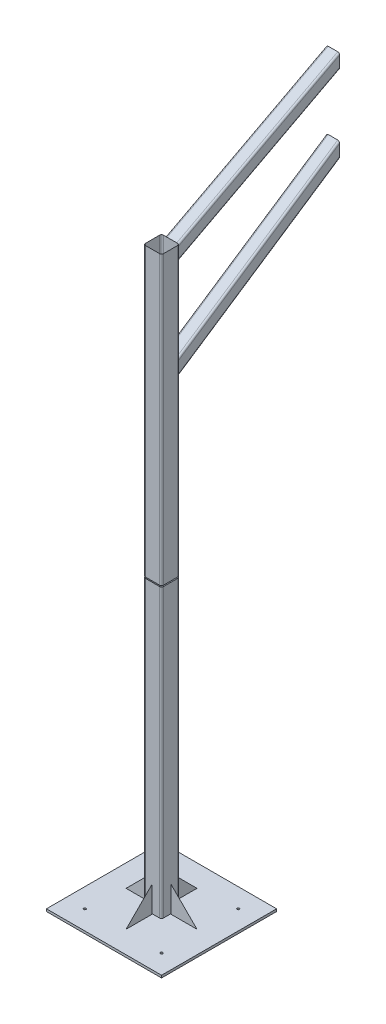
ISO-10303-21;
HEADER;
FILE_DESCRIPTION(('STEP AP214'),'2;1');
FILE_NAME('part.step','',(''),(''),'','','');
FILE_SCHEMA(('AUTOMOTIVE_DESIGN { 1 0 10303 214 1 1 1 1 }'));
ENDSEC;
DATA;
#1=APPLICATION_CONTEXT('core data for automotive mechanical design processes');
#2=APPLICATION_PROTOCOL_DEFINITION('international standard','automotive_design',2000,#1);
#3=PRODUCT_CONTEXT('',#1,'mechanical');
#4=PRODUCT('Part','Part','',(#3));
#5=PRODUCT_RELATED_PRODUCT_CATEGORY('part','',(#4));
#6=PRODUCT_DEFINITION_FORMATION('','',#4);
#7=PRODUCT_DEFINITION_CONTEXT('part definition',#1,'design');
#8=PRODUCT_DEFINITION('design','',#6,#7);
#9=PRODUCT_DEFINITION_SHAPE('','',#8);
#10=(LENGTH_UNIT() NAMED_UNIT(*) SI_UNIT(.MILLI.,.METRE.));
#11=(NAMED_UNIT(*) PLANE_ANGLE_UNIT() SI_UNIT($,.RADIAN.));
#12=(NAMED_UNIT(*) SI_UNIT($,.STERADIAN.) SOLID_ANGLE_UNIT());
#13=UNCERTAINTY_MEASURE_WITH_UNIT(LENGTH_MEASURE(1.E-05),#10,'distance_accuracy_value','');
#14=(GEOMETRIC_REPRESENTATION_CONTEXT(3) GLOBAL_UNCERTAINTY_ASSIGNED_CONTEXT((#13)) GLOBAL_UNIT_ASSIGNED_CONTEXT((#10,
#11,#12)) REPRESENTATION_CONTEXT('',''));
#15=CARTESIAN_POINT('',(0.,0.,0.));
#16=DIRECTION('',(0.,0.,1.));
#17=DIRECTION('',(1.,0.,0.));
#18=AXIS2_PLACEMENT_3D('',#15,#16,#17);
#19=CARTESIAN_POINT('',(47.625,3048.,38.1));
#20=DIRECTION('',(-1.,0.,0.));
#21=DIRECTION('',(0.,0.,1.));
#22=AXIS2_PLACEMENT_3D('',#19,#20,#21);
#23=PLANE('',#22);
#24=DIRECTION('',(0.,0.,-1.));
#25=VECTOR('',#24,1.);
#26=CARTESIAN_POINT('',(47.625,3048.,38.1));
#27=LINE('',#26,#25);
#28=CARTESIAN_POINT('',(47.625,3048.,38.1));
#29=VERTEX_POINT('',#28);
#30=CARTESIAN_POINT('',(47.625,3048.,-38.1));
#31=VERTEX_POINT('',#30);
#32=EDGE_CURVE('E130',#29,#31,#27,.T.);
#33=ORIENTED_EDGE('',*,*,#32,.T.);
#34=DIRECTION('',(0.,1.,0.));
#35=VECTOR('',#34,1.);
#36=CARTESIAN_POINT('',(47.625,3048.,-38.1));
#37=LINE('',#36,#35);
#38=CARTESIAN_POINT('',(47.625,1527.175,-38.1));
#39=VERTEX_POINT('',#38);
#40=EDGE_CURVE('E14',#31,#39,#37,.F.);
#41=ORIENTED_EDGE('',*,*,#40,.T.);
#42=DIRECTION('',(0.,0.,-1.));
#43=VECTOR('',#42,1.);
#44=CARTESIAN_POINT('',(47.625,1527.175,38.1));
#45=LINE('',#44,#43);
#46=CARTESIAN_POINT('',(47.625,1527.175,38.1));
#47=VERTEX_POINT('',#46);
#48=EDGE_CURVE('E218',#39,#47,#45,.F.);
#49=ORIENTED_EDGE('',*,*,#48,.T.);
#50=DIRECTION('',(0.,-1.,0.));
#51=VECTOR('',#50,1.);
#52=CARTESIAN_POINT('',(47.625,3048.,38.1));
#53=LINE('',#52,#51);
#54=EDGE_CURVE('E216',#29,#47,#53,.T.);
#55=ORIENTED_EDGE('',*,*,#54,.F.);
#56=EDGE_LOOP('',(#33,#41,#49,#55));
#57=FACE_BOUND('',#56,.T.);
#58=ADVANCED_FACE('F122',(#57),#23,.T.);
#59=CARTESIAN_POINT('',(38.1,3048.,-38.1));
#60=DIRECTION('',(0.,-1.,0.));
#61=DIRECTION('',(0.,0.,-1.));
#62=AXIS2_PLACEMENT_3D('',#59,#60,#61);
#63=CYLINDRICAL_SURFACE('',#62,9.525);
#64=CARTESIAN_POINT('',(38.1,3048.,-38.1));
#65=DIRECTION('',(0.,1.,0.));
#66=DIRECTION('',(0.,0.,1.));
#67=AXIS2_PLACEMENT_3D('',#64,#65,#66);
#68=CIRCLE('',#67,9.525);
#69=CARTESIAN_POINT('',(38.1,3048.,-47.625));
#70=VERTEX_POINT('',#69);
#71=EDGE_CURVE('E222',#31,#70,#68,.T.);
#72=ORIENTED_EDGE('',*,*,#71,.T.);
#73=DIRECTION('',(0.,-1.,0.));
#74=VECTOR('',#73,1.);
#75=CARTESIAN_POINT('',(38.1,3048.,-47.625));
#76=LINE('',#75,#74);
#77=CARTESIAN_POINT('',(38.1,1527.175,-47.625));
#78=VERTEX_POINT('',#77);
#79=EDGE_CURVE('E219',#70,#78,#76,.T.);
#80=ORIENTED_EDGE('',*,*,#79,.T.);
#81=CARTESIAN_POINT('',(38.1,1527.175,-38.1));
#82=DIRECTION('',(0.,1.,0.));
#83=DIRECTION('',(0.,0.,1.));
#84=AXIS2_PLACEMENT_3D('',#81,#82,#83);
#85=CIRCLE('',#84,9.525);
#86=EDGE_CURVE('E223',#78,#39,#85,.F.);
#87=ORIENTED_EDGE('',*,*,#86,.T.);
#88=ORIENTED_EDGE('',*,*,#40,.F.);
#89=EDGE_LOOP('',(#72,#80,#87,#88));
#90=FACE_BOUND('',#89,.T.);
#91=ADVANCED_FACE('F332',(#90),#63,.F.);
#92=CARTESIAN_POINT('',(38.1,3048.,38.1));
#93=DIRECTION('',(0.,-1.,0.));
#94=DIRECTION('',(0.,0.,-1.));
#95=AXIS2_PLACEMENT_3D('',#92,#93,#94);
#96=CYLINDRICAL_SURFACE('',#95,9.525);
#97=CARTESIAN_POINT('',(38.1,3048.,38.1));
#98=DIRECTION('',(0.,1.,0.));
#99=DIRECTION('',(0.,0.,1.));
#100=AXIS2_PLACEMENT_3D('',#97,#98,#99);
#101=CIRCLE('',#100,9.525);
#102=CARTESIAN_POINT('',(38.1,3048.,47.625));
#103=VERTEX_POINT('',#102);
#104=EDGE_CURVE('E264',#103,#29,#101,.T.);
#105=ORIENTED_EDGE('',*,*,#104,.T.);
#106=ORIENTED_EDGE('',*,*,#54,.T.);
#107=CARTESIAN_POINT('',(38.1,1527.175,38.1));
#108=DIRECTION('',(0.,1.,0.));
#109=DIRECTION('',(0.,0.,1.));
#110=AXIS2_PLACEMENT_3D('',#107,#108,#109);
#111=CIRCLE('',#110,9.525);
#112=CARTESIAN_POINT('',(38.1,1527.175,47.625));
#113=VERTEX_POINT('',#112);
#114=EDGE_CURVE('E226',#47,#113,#111,.F.);
#115=ORIENTED_EDGE('',*,*,#114,.T.);
#116=DIRECTION('',(0.,1.,0.));
#117=VECTOR('',#116,1.);
#118=CARTESIAN_POINT('',(38.1,3048.,47.625));
#119=LINE('',#118,#117);
#120=EDGE_CURVE('E224',#103,#113,#119,.F.);
#121=ORIENTED_EDGE('',*,*,#120,.F.);
#122=EDGE_LOOP('',(#105,#106,#115,#121));
#123=FACE_BOUND('',#122,.T.);
#124=ADVANCED_FACE('F284',(#123),#96,.F.);
#125=CARTESIAN_POINT('',(-38.1,3048.,-47.625));
#126=DIRECTION('',(0.,0.,1.));
#127=DIRECTION('',(1.,0.,0.));
#128=AXIS2_PLACEMENT_3D('',#125,#126,#127);
#129=PLANE('',#128);
#130=DIRECTION('',(-1.,0.,0.));
#131=VECTOR('',#130,1.);
#132=CARTESIAN_POINT('',(-38.1,3048.,-47.625));
#133=LINE('',#132,#131);
#134=CARTESIAN_POINT('',(-38.1,3048.,-47.625));
#135=VERTEX_POINT('',#134);
#136=EDGE_CURVE('E227',#70,#135,#133,.T.);
#137=ORIENTED_EDGE('',*,*,#136,.T.);
#138=DIRECTION('',(0.,-1.,0.));
#139=VECTOR('',#138,1.);
#140=CARTESIAN_POINT('',(-38.1,2289.175,-47.625));
#141=LINE('',#140,#139);
#142=CARTESIAN_POINT('',(-38.1,1527.175,-47.625));
#143=VERTEX_POINT('',#142);
#144=EDGE_CURVE('E236',#135,#143,#141,.T.);
#145=ORIENTED_EDGE('',*,*,#144,.T.);
#146=DIRECTION('',(-1.,0.,0.));
#147=VECTOR('',#146,1.);
#148=CARTESIAN_POINT('',(-38.1,1527.175,-47.625));
#149=LINE('',#148,#147);
#150=EDGE_CURVE('E247',#143,#78,#149,.F.);
#151=ORIENTED_EDGE('',*,*,#150,.T.);
#152=ORIENTED_EDGE('',*,*,#79,.F.);
#153=EDGE_LOOP('',(#137,#145,#151,#152));
#154=FACE_BOUND('',#153,.T.);
#155=ADVANCED_FACE('F240',(#154),#129,.T.);
#156=CARTESIAN_POINT('',(38.1,3048.,47.625));
#157=DIRECTION('',(0.,0.,-1.));
#158=DIRECTION('',(-1.,0.,0.));
#159=AXIS2_PLACEMENT_3D('',#156,#157,#158);
#160=PLANE('',#159);
#161=DIRECTION('',(0.,-1.,0.));
#162=VECTOR('',#161,1.);
#163=CARTESIAN_POINT('',(-38.1,3048.,47.625));
#164=LINE('',#163,#162);
#165=CARTESIAN_POINT('',(-38.1,3048.,47.625));
#166=VERTEX_POINT('',#165);
#167=CARTESIAN_POINT('',(-38.1,1527.175,47.625));
#168=VERTEX_POINT('',#167);
#169=EDGE_CURVE('E193',#166,#168,#164,.T.);
#170=ORIENTED_EDGE('',*,*,#169,.F.);
#171=DIRECTION('',(1.,0.,0.));
#172=VECTOR('',#171,1.);
#173=CARTESIAN_POINT('',(38.1,3048.,47.625));
#174=LINE('',#173,#172);
#175=EDGE_CURVE('E228',#166,#103,#174,.T.);
#176=ORIENTED_EDGE('',*,*,#175,.T.);
#177=ORIENTED_EDGE('',*,*,#120,.T.);
#178=DIRECTION('',(1.,0.,0.));
#179=VECTOR('',#178,1.);
#180=CARTESIAN_POINT('',(38.1,1527.175,47.625));
#181=LINE('',#180,#179);
#182=EDGE_CURVE('E211',#113,#168,#181,.F.);
#183=ORIENTED_EDGE('',*,*,#182,.T.);
#184=EDGE_LOOP('',(#170,#176,#177,#183));
#185=FACE_BOUND('',#184,.T.);
#186=ADVANCED_FACE('F287',(#185),#160,.T.);
#187=CARTESIAN_POINT('',(-38.1,3048.,-38.1));
#188=DIRECTION('',(0.,-1.,0.));
#189=DIRECTION('',(0.,0.,-1.));
#190=AXIS2_PLACEMENT_3D('',#187,#188,#189);
#191=CYLINDRICAL_SURFACE('',#190,9.52500000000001);
#192=CARTESIAN_POINT('',(-38.1,3048.,-38.1));
#193=DIRECTION('',(0.,1.,0.));
#194=DIRECTION('',(0.,0.,1.));
#195=AXIS2_PLACEMENT_3D('',#192,#193,#194);
#196=CIRCLE('',#195,9.52500000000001);
#197=CARTESIAN_POINT('',(-47.625,3048.,-38.1));
#198=VERTEX_POINT('',#197);
#199=EDGE_CURVE('E207',#135,#198,#196,.T.);
#200=ORIENTED_EDGE('',*,*,#199,.T.);
#201=DIRECTION('',(0.,-1.,0.));
#202=VECTOR('',#201,1.);
#203=CARTESIAN_POINT('',(-47.625,3048.,-38.1));
#204=LINE('',#203,#202);
#205=CARTESIAN_POINT('',(-47.625,1527.175,-38.1));
#206=VERTEX_POINT('',#205);
#207=EDGE_CURVE('E212',#198,#206,#204,.T.);
#208=ORIENTED_EDGE('',*,*,#207,.T.);
#209=CARTESIAN_POINT('',(-38.1,1527.175,-38.1));
#210=DIRECTION('',(0.,1.,0.));
#211=DIRECTION('',(0.,0.,1.));
#212=AXIS2_PLACEMENT_3D('',#209,#210,#211);
#213=CIRCLE('',#212,9.52500000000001);
#214=EDGE_CURVE('E202',#206,#143,#213,.F.);
#215=ORIENTED_EDGE('',*,*,#214,.T.);
#216=ORIENTED_EDGE('',*,*,#144,.F.);
#217=EDGE_LOOP('',(#200,#208,#215,#216));
#218=FACE_BOUND('',#217,.T.);
#219=ADVANCED_FACE('F231',(#218),#191,.F.);
#220=CARTESIAN_POINT('',(-38.1,3048.,38.1));
#221=DIRECTION('',(0.,-1.,0.));
#222=DIRECTION('',(0.,0.,-1.));
#223=AXIS2_PLACEMENT_3D('',#220,#221,#222);
#224=CYLINDRICAL_SURFACE('',#223,9.525);
#225=CARTESIAN_POINT('',(-38.1,3048.,38.1));
#226=DIRECTION('',(0.,1.,0.));
#227=DIRECTION('',(0.,0.,1.));
#228=AXIS2_PLACEMENT_3D('',#225,#226,#227);
#229=CIRCLE('',#228,9.525);
#230=CARTESIAN_POINT('',(-47.625,3048.,38.1));
#231=VERTEX_POINT('',#230);
#232=EDGE_CURVE('E196',#231,#166,#229,.T.);
#233=ORIENTED_EDGE('',*,*,#232,.T.);
#234=ORIENTED_EDGE('',*,*,#169,.T.);
#235=CARTESIAN_POINT('',(-38.1,1527.175,38.1));
#236=DIRECTION('',(0.,1.,0.));
#237=DIRECTION('',(0.,0.,1.));
#238=AXIS2_PLACEMENT_3D('',#235,#236,#237);
#239=CIRCLE('',#238,9.525);
#240=CARTESIAN_POINT('',(-47.625,1527.175,38.1));
#241=VERTEX_POINT('',#240);
#242=EDGE_CURVE('E187',#168,#241,#239,.F.);
#243=ORIENTED_EDGE('',*,*,#242,.T.);
#244=DIRECTION('',(0.,1.,0.));
#245=VECTOR('',#244,1.);
#246=CARTESIAN_POINT('',(-47.625,3048.,38.1));
#247=LINE('',#246,#245);
#248=EDGE_CURVE('E125',#231,#241,#247,.F.);
#249=ORIENTED_EDGE('',*,*,#248,.F.);
#250=EDGE_LOOP('',(#233,#234,#243,#249));
#251=FACE_BOUND('',#250,.T.);
#252=ADVANCED_FACE('F191',(#251),#224,.F.);
#253=CARTESIAN_POINT('',(-47.625,3048.,-38.1));
#254=DIRECTION('',(1.,0.,0.));
#255=DIRECTION('',(0.,0.,-1.));
#256=AXIS2_PLACEMENT_3D('',#253,#254,#255);
#257=PLANE('',#256);
#258=DIRECTION('',(0.,0.,1.));
#259=VECTOR('',#258,1.);
#260=CARTESIAN_POINT('',(-47.625,3048.,-38.1));
#261=LINE('',#260,#259);
#262=EDGE_CURVE('E179',#198,#231,#261,.T.);
#263=ORIENTED_EDGE('',*,*,#262,.T.);
#264=ORIENTED_EDGE('',*,*,#248,.T.);
#265=DIRECTION('',(0.,0.,1.));
#266=VECTOR('',#265,1.);
#267=CARTESIAN_POINT('',(-47.625,1527.175,-38.1));
#268=LINE('',#267,#266);
#269=EDGE_CURVE('E183',#241,#206,#268,.F.);
#270=ORIENTED_EDGE('',*,*,#269,.T.);
#271=ORIENTED_EDGE('',*,*,#207,.F.);
#272=EDGE_LOOP('',(#263,#264,#270,#271));
#273=FACE_BOUND('',#272,.T.);
#274=ADVANCED_FACE('F123',(#273),#257,.T.);
#275=OPEN_SHELL('',(#58,#91,#124,#155,#186,#219,#252,#274));
#276=SHELL_BASED_SURFACE_MODEL('B2',(#275));
#277=CARTESIAN_POINT('',(34.925,2949.33662727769,-11.8556689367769));
#278=DIRECTION('',(-1.,0.,0.));
#279=DIRECTION('',(0.,0.,1.));
#280=AXIS2_PLACEMENT_3D('',#277,#278,#279);
#281=PLANE('',#280);
#282=DIRECTION('',(0.,0.466758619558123,-0.88438475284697));
#283=VECTOR('',#282,1.);
#284=CARTESIAN_POINT('',(34.925,2969.89057978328,-50.8000000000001));
#285=LINE('',#284,#283);
#286=CARTESIAN_POINT('',(34.9249999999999,2969.89057978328,-50.8));
#287=VERTEX_POINT('',#286);
#288=CARTESIAN_POINT('',(34.9249999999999,3422.32807978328,-908.05));
#289=VERTEX_POINT('',#288);
#290=EDGE_CURVE('E424',#287,#289,#285,.T.);
#291=ORIENTED_EDGE('',*,*,#290,.T.);
#292=DIRECTION('',(0.,1.,0.));
#293=VECTOR('',#292,1.);
#294=CARTESIAN_POINT('',(34.925,2949.33662727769,-908.05));
#295=LINE('',#294,#293);
#296=CARTESIAN_POINT('',(34.9249999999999,3479.76914243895,-908.05));
#297=VERTEX_POINT('',#296);
#298=EDGE_CURVE('E120',#289,#297,#295,.T.);
#299=ORIENTED_EDGE('',*,*,#298,.T.);
#300=DIRECTION('',(0.,0.466758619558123,-0.88438475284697));
#301=VECTOR('',#300,1.);
#302=CARTESIAN_POINT('',(34.9249999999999,2994.26337272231,11.8556689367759));
#303=LINE('',#302,#301);
#304=CARTESIAN_POINT('',(34.9249999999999,3027.33164243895,-50.8));
#305=VERTEX_POINT('',#304);
#306=EDGE_CURVE('E550',#305,#297,#303,.T.);
#307=ORIENTED_EDGE('',*,*,#306,.F.);
#308=DIRECTION('',(0.,-1.,0.));
#309=VECTOR('',#308,1.);
#310=CARTESIAN_POINT('',(34.925,2949.33662727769,-50.8));
#311=LINE('',#310,#309);
#312=EDGE_CURVE('E547',#305,#287,#311,.T.);
#313=ORIENTED_EDGE('',*,*,#312,.T.);
#314=EDGE_LOOP('',(#291,#299,#307,#313));
#315=FACE_BOUND('',#314,.T.);
#316=ADVANCED_FACE('F415',(#315),#281,.F.);
#317=CARTESIAN_POINT('',(25.4,2949.33662727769,-11.8556689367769));
#318=DIRECTION('',(0.,0.466758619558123,-0.88438475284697));
#319=DIRECTION('',(0.,0.88438475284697,0.466758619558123));
#320=AXIS2_PLACEMENT_3D('',#317,#318,#319);
#321=CYLINDRICAL_SURFACE('',#320,9.52499999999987);
#322=DIRECTION('',(0.,0.466758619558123,-0.88438475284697));
#323=VECTOR('',#322,1.);
#324=CARTESIAN_POINT('',(25.4,2940.91286250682,-16.301544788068));
#325=LINE('',#324,#323);
#326=CARTESIAN_POINT('',(25.4,2959.12038053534,-50.8));
#327=VERTEX_POINT('',#326);
#328=CARTESIAN_POINT('',(25.4,3411.55788053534,-908.05));
#329=VERTEX_POINT('',#328);
#330=EDGE_CURVE('E542',#327,#329,#325,.T.);
#331=ORIENTED_EDGE('',*,*,#330,.T.);
#332=CARTESIAN_POINT('',(25.4,3422.32807978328,-908.05));
#333=DIRECTION('',(0.,0.,1.));
#334=DIRECTION('',(0.,1.,0.));
#335=AXIS2_PLACEMENT_3D('',#332,#333,#334);
#336=ELLIPSE('',#335,10.7701992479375,9.52499999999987);
#337=EDGE_CURVE('E433',#329,#289,#336,.T.);
#338=ORIENTED_EDGE('',*,*,#337,.T.);
#339=ORIENTED_EDGE('',*,*,#290,.F.);
#340=CARTESIAN_POINT('',(25.4,2969.89057978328,-50.8));
#341=DIRECTION('',(0.,0.,-1.));
#342=DIRECTION('',(0.,1.,0.));
#343=AXIS2_PLACEMENT_3D('',#340,#341,#342);
#344=ELLIPSE('',#343,10.7701992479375,9.52499999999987);
#345=EDGE_CURVE('E535',#287,#327,#344,.T.);
#346=ORIENTED_EDGE('',*,*,#345,.T.);
#347=EDGE_LOOP('',(#331,#338,#339,#346));
#348=FACE_BOUND('',#347,.T.);
#349=ADVANCED_FACE('F597',(#348),#321,.T.);
#350=CARTESIAN_POINT('',(25.4,2994.26337272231,11.8556689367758));
#351=DIRECTION('',(0.,0.466758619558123,-0.88438475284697));
#352=DIRECTION('',(0.,0.88438475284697,0.466758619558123));
#353=AXIS2_PLACEMENT_3D('',#350,#351,#352);
#354=CYLINDRICAL_SURFACE('',#353,9.52499999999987);
#355=ORIENTED_EDGE('',*,*,#306,.T.);
#356=CARTESIAN_POINT('',(25.4,3479.76914243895,-908.05));
#357=DIRECTION('',(0.,0.,1.));
#358=DIRECTION('',(0.,1.,0.));
#359=AXIS2_PLACEMENT_3D('',#356,#357,#358);
#360=ELLIPSE('',#359,10.7701992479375,9.52499999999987);
#361=CARTESIAN_POINT('',(25.4,3490.53934168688,-908.05));
#362=VERTEX_POINT('',#361);
#363=EDGE_CURVE('E530',#297,#362,#360,.T.);
#364=ORIENTED_EDGE('',*,*,#363,.T.);
#365=DIRECTION('',(0.,0.466758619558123,-0.88438475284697));
#366=VECTOR('',#365,1.);
#367=CARTESIAN_POINT('',(25.4,3002.68713749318,16.3015447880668));
#368=LINE('',#367,#366);
#369=CARTESIAN_POINT('',(25.4,3038.10184168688,-50.8));
#370=VERTEX_POINT('',#369);
#371=EDGE_CURVE('E538',#370,#362,#368,.T.);
#372=ORIENTED_EDGE('',*,*,#371,.F.);
#373=CARTESIAN_POINT('',(25.4,3027.33164243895,-50.8));
#374=DIRECTION('',(0.,0.,-1.));
#375=DIRECTION('',(0.,1.,0.));
#376=AXIS2_PLACEMENT_3D('',#373,#374,#375);
#377=ELLIPSE('',#376,10.7701992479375,9.52499999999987);
#378=EDGE_CURVE('E536',#370,#305,#377,.T.);
#379=ORIENTED_EDGE('',*,*,#378,.T.);
#380=EDGE_LOOP('',(#355,#364,#372,#379));
#381=FACE_BOUND('',#380,.T.);
#382=ADVANCED_FACE('F604',(#381),#354,.T.);
#383=CARTESIAN_POINT('',(25.4,2940.91286250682,-16.301544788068));
#384=DIRECTION('',(0.,0.88438475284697,0.466758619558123));
#385=DIRECTION('',(0.,-0.466758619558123,0.88438475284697));
#386=AXIS2_PLACEMENT_3D('',#383,#384,#385);
#387=PLANE('',#386);
#388=DIRECTION('',(0.,-0.466758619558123,0.88438475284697));
#389=VECTOR('',#388,1.);
#390=CARTESIAN_POINT('',(-25.4,2940.91286250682,-16.301544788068));
#391=LINE('',#390,#389);
#392=CARTESIAN_POINT('',(-25.4,2959.12038053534,-50.8));
#393=VERTEX_POINT('',#392);
#394=CARTESIAN_POINT('',(-25.4,3411.55788053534,-908.05));
#395=VERTEX_POINT('',#394);
#396=EDGE_CURVE('E517',#393,#395,#391,.F.);
#397=ORIENTED_EDGE('',*,*,#396,.T.);
#398=DIRECTION('',(1.,0.,0.));
#399=VECTOR('',#398,1.);
#400=CARTESIAN_POINT('',(25.4,3411.55788053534,-908.05));
#401=LINE('',#400,#399);
#402=EDGE_CURVE('E512',#395,#329,#401,.T.);
#403=ORIENTED_EDGE('',*,*,#402,.T.);
#404=ORIENTED_EDGE('',*,*,#330,.F.);
#405=DIRECTION('',(-1.,0.,0.));
#406=VECTOR('',#405,1.);
#407=CARTESIAN_POINT('',(25.4,2959.12038053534,-50.8));
#408=LINE('',#407,#406);
#409=EDGE_CURVE('E518',#327,#393,#408,.T.);
#410=ORIENTED_EDGE('',*,*,#409,.T.);
#411=EDGE_LOOP('',(#397,#403,#404,#410));
#412=FACE_BOUND('',#411,.T.);
#413=ADVANCED_FACE('F577',(#412),#387,.F.);
#414=CARTESIAN_POINT('',(-25.4,3002.68713749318,16.3015447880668));
#415=DIRECTION('',(0.,-0.88438475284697,-0.466758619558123));
#416=DIRECTION('',(0.,0.466758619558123,-0.88438475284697));
#417=AXIS2_PLACEMENT_3D('',#414,#415,#416);
#418=PLANE('',#417);
#419=ORIENTED_EDGE('',*,*,#371,.T.);
#420=DIRECTION('',(-1.,0.,0.));
#421=VECTOR('',#420,1.);
#422=CARTESIAN_POINT('',(-25.4,3490.53934168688,-908.05));
#423=LINE('',#422,#421);
#424=CARTESIAN_POINT('',(-25.4,3490.53934168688,-908.05));
#425=VERTEX_POINT('',#424);
#426=EDGE_CURVE('E523',#362,#425,#423,.T.);
#427=ORIENTED_EDGE('',*,*,#426,.T.);
#428=DIRECTION('',(0.,0.466758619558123,-0.88438475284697));
#429=VECTOR('',#428,1.);
#430=CARTESIAN_POINT('',(-25.4,3002.68713749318,16.3015447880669));
#431=LINE('',#430,#429);
#432=CARTESIAN_POINT('',(-25.4,3038.10184168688,-50.8));
#433=VERTEX_POINT('',#432);
#434=EDGE_CURVE('E491',#433,#425,#431,.T.);
#435=ORIENTED_EDGE('',*,*,#434,.F.);
#436=DIRECTION('',(1.,0.,0.));
#437=VECTOR('',#436,1.);
#438=CARTESIAN_POINT('',(-25.4,3038.10184168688,-50.8));
#439=LINE('',#438,#437);
#440=EDGE_CURVE('E520',#433,#370,#439,.T.);
#441=ORIENTED_EDGE('',*,*,#440,.T.);
#442=EDGE_LOOP('',(#419,#427,#435,#441));
#443=FACE_BOUND('',#442,.T.);
#444=ADVANCED_FACE('F611',(#443),#418,.F.);
#445=CARTESIAN_POINT('',(-25.4,2949.33662727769,-11.8556689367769));
#446=DIRECTION('',(0.,0.466758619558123,-0.88438475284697));
#447=DIRECTION('',(0.,0.88438475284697,0.466758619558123));
#448=AXIS2_PLACEMENT_3D('',#445,#446,#447);
#449=CYLINDRICAL_SURFACE('',#448,9.52499999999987);
#450=DIRECTION('',(0.,0.466758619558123,-0.88438475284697));
#451=VECTOR('',#450,1.);
#452=CARTESIAN_POINT('',(-34.9249999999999,2949.33662727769,-11.8556689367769));
#453=LINE('',#452,#451);
#454=CARTESIAN_POINT('',(-34.9249999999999,2969.89057978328,-50.8));
#455=VERTEX_POINT('',#454);
#456=CARTESIAN_POINT('',(-34.9249999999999,3422.32807978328,-908.05));
#457=VERTEX_POINT('',#456);
#458=EDGE_CURVE('E565',#455,#457,#453,.T.);
#459=ORIENTED_EDGE('',*,*,#458,.T.);
#460=CARTESIAN_POINT('',(-25.4,3422.32807978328,-908.05));
#461=DIRECTION('',(0.,0.,1.));
#462=DIRECTION('',(0.,1.,0.));
#463=AXIS2_PLACEMENT_3D('',#460,#461,#462);
#464=ELLIPSE('',#463,10.7701992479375,9.52499999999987);
#465=EDGE_CURVE('E501',#457,#395,#464,.T.);
#466=ORIENTED_EDGE('',*,*,#465,.T.);
#467=ORIENTED_EDGE('',*,*,#396,.F.);
#468=CARTESIAN_POINT('',(-25.4,2969.89057978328,-50.8));
#469=DIRECTION('',(0.,0.,-1.));
#470=DIRECTION('',(0.,1.,0.));
#471=AXIS2_PLACEMENT_3D('',#468,#469,#470);
#472=ELLIPSE('',#471,10.7701992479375,9.52499999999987);
#473=EDGE_CURVE('E494',#393,#455,#472,.T.);
#474=ORIENTED_EDGE('',*,*,#473,.T.);
#475=EDGE_LOOP('',(#459,#466,#467,#474));
#476=FACE_BOUND('',#475,.T.);
#477=ADVANCED_FACE('F573',(#476),#449,.T.);
#478=CARTESIAN_POINT('',(-25.4,2994.26337272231,11.8556689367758));
#479=DIRECTION('',(0.,0.466758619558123,-0.88438475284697));
#480=DIRECTION('',(0.,0.88438475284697,0.466758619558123));
#481=AXIS2_PLACEMENT_3D('',#478,#479,#480);
#482=CYLINDRICAL_SURFACE('',#481,9.52499999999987);
#483=ORIENTED_EDGE('',*,*,#434,.T.);
#484=CARTESIAN_POINT('',(-25.4,3479.76914243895,-908.05));
#485=DIRECTION('',(0.,0.,1.));
#486=DIRECTION('',(0.,1.,0.));
#487=AXIS2_PLACEMENT_3D('',#484,#485,#486);
#488=ELLIPSE('',#487,10.7701992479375,9.52499999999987);
#489=CARTESIAN_POINT('',(-34.9249999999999,3479.76914243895,-908.05));
#490=VERTEX_POINT('',#489);
#491=EDGE_CURVE('E488',#425,#490,#488,.T.);
#492=ORIENTED_EDGE('',*,*,#491,.T.);
#493=DIRECTION('',(0.,0.466758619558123,-0.88438475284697));
#494=VECTOR('',#493,1.);
#495=CARTESIAN_POINT('',(-34.925,3027.33164243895,-50.8000000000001));
#496=LINE('',#495,#494);
#497=CARTESIAN_POINT('',(-34.9249999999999,3027.33164243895,-50.8));
#498=VERTEX_POINT('',#497);
#499=EDGE_CURVE('E418',#498,#490,#496,.T.);
#500=ORIENTED_EDGE('',*,*,#499,.F.);
#501=CARTESIAN_POINT('',(-25.4,3027.33164243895,-50.8));
#502=DIRECTION('',(0.,0.,-1.));
#503=DIRECTION('',(0.,1.,0.));
#504=AXIS2_PLACEMENT_3D('',#501,#502,#503);
#505=ELLIPSE('',#504,10.7701992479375,9.52499999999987);
#506=EDGE_CURVE('E485',#498,#433,#505,.T.);
#507=ORIENTED_EDGE('',*,*,#506,.T.);
#508=EDGE_LOOP('',(#483,#492,#500,#507));
#509=FACE_BOUND('',#508,.T.);
#510=ADVANCED_FACE('F489',(#509),#482,.T.);
#511=CARTESIAN_POINT('',(-34.925,2994.26337272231,11.8556689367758));
#512=DIRECTION('',(1.,0.,0.));
#513=DIRECTION('',(0.,0.,-1.));
#514=AXIS2_PLACEMENT_3D('',#511,#512,#513);
#515=PLANE('',#514);
#516=ORIENTED_EDGE('',*,*,#458,.F.);
#517=DIRECTION('',(0.,1.,0.));
#518=VECTOR('',#517,1.);
#519=CARTESIAN_POINT('',(-34.925,2994.26337272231,-50.8));
#520=LINE('',#519,#518);
#521=EDGE_CURVE('E477',#455,#498,#520,.T.);
#522=ORIENTED_EDGE('',*,*,#521,.T.);
#523=ORIENTED_EDGE('',*,*,#499,.T.);
#524=DIRECTION('',(0.,-1.,0.));
#525=VECTOR('',#524,1.);
#526=CARTESIAN_POINT('',(-34.925,2994.26337272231,-908.05));
#527=LINE('',#526,#525);
#528=EDGE_CURVE('E480',#490,#457,#527,.T.);
#529=ORIENTED_EDGE('',*,*,#528,.T.);
#530=EDGE_LOOP('',(#516,#522,#523,#529));
#531=FACE_BOUND('',#530,.T.);
#532=ADVANCED_FACE('F416',(#531),#515,.F.);
#533=OPEN_SHELL('',(#316,#349,#382,#413,#444,#477,#510,#532));
#534=SHELL_BASED_SURFACE_MODEL('B8',(#533));
#535=CARTESIAN_POINT('',(34.925,3069.13407747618,-900.310615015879));
#536=DIRECTION('',(-1.,0.,0.));
#537=DIRECTION('',(0.,0.,1.));
#538=AXIS2_PLACEMENT_3D('',#535,#536,#537);
#539=PLANE('',#538);
#540=DIRECTION('',(0.,-0.554700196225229,0.832050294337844));
#541=VECTOR('',#540,1.);
#542=CARTESIAN_POINT('',(34.9249999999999,3026.86592252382,-928.48938498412));
#543=LINE('',#542,#541);
#544=CARTESIAN_POINT('',(34.9249999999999,3013.23966586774,-908.05));
#545=VERTEX_POINT('',#544);
#546=CARTESIAN_POINT('',(34.9249999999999,2441.73966586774,-50.8000000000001));
#547=VERTEX_POINT('',#546);
#548=EDGE_CURVE('E727',#545,#547,#543,.T.);
#549=ORIENTED_EDGE('',*,*,#548,.F.);
#550=DIRECTION('',(0.,1.,0.));
#551=VECTOR('',#550,1.);
#552=CARTESIAN_POINT('',(34.925,3069.13407747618,-908.05));
#553=LINE('',#552,#551);
#554=CARTESIAN_POINT('',(34.9249999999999,3074.2936674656,-908.05));
#555=VERTEX_POINT('',#554);
#556=EDGE_CURVE('E413',#545,#555,#553,.T.);
#557=ORIENTED_EDGE('',*,*,#556,.T.);
#558=DIRECTION('',(0.,-0.554700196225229,0.832050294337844));
#559=VECTOR('',#558,1.);
#560=CARTESIAN_POINT('',(34.925,3074.2936674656,-908.05));
#561=LINE('',#560,#559);
#562=CARTESIAN_POINT('',(34.925,2502.7936674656,-50.8000000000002));
#563=VERTEX_POINT('',#562);
#564=EDGE_CURVE('E978',#555,#563,#561,.T.);
#565=ORIENTED_EDGE('',*,*,#564,.T.);
#566=DIRECTION('',(0.,-1.,0.));
#567=VECTOR('',#566,1.);
#568=CARTESIAN_POINT('',(34.925,3069.13407747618,-50.8000000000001));
#569=LINE('',#568,#567);
#570=EDGE_CURVE('E855',#563,#547,#569,.T.);
#571=ORIENTED_EDGE('',*,*,#570,.T.);
#572=EDGE_LOOP('',(#549,#557,#565,#571));
#573=FACE_BOUND('',#572,.T.);
#574=ADVANCED_FACE('F718',(#573),#539,.F.);
#575=CARTESIAN_POINT('',(25.4,3026.86592252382,-928.489384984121));
#576=DIRECTION('',(0.,-0.554700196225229,0.832050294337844));
#577=DIRECTION('',(0.,-0.832050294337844,-0.554700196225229));
#578=AXIS2_PLACEMENT_3D('',#575,#576,#577);
#579=CYLINDRICAL_SURFACE('',#578,9.52499999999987);
#580=CARTESIAN_POINT('',(25.4,3013.23966586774,-908.05));
#581=DIRECTION('',(0.,0.,1.));
#582=DIRECTION('',(0.,-1.,0.));
#583=AXIS2_PLACEMENT_3D('',#580,#581,#582);
#584=ELLIPSE('',#583,11.447625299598,9.52499999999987);
#585=CARTESIAN_POINT('',(25.4,3001.79204056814,-908.05));
#586=VERTEX_POINT('',#585);
#587=EDGE_CURVE('E736',#586,#545,#584,.T.);
#588=ORIENTED_EDGE('',*,*,#587,.T.);
#589=ORIENTED_EDGE('',*,*,#548,.T.);
#590=CARTESIAN_POINT('',(25.4,2441.73966586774,-50.8000000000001));
#591=DIRECTION('',(0.,0.,-1.));
#592=DIRECTION('',(0.,-1.,0.));
#593=AXIS2_PLACEMENT_3D('',#590,#591,#592);
#594=ELLIPSE('',#593,11.447625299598,9.52499999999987);
#595=CARTESIAN_POINT('',(25.4,2430.29204056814,-50.8000000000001));
#596=VERTEX_POINT('',#595);
#597=EDGE_CURVE('E859',#547,#596,#594,.T.);
#598=ORIENTED_EDGE('',*,*,#597,.T.);
#599=DIRECTION('',(0.,-0.554700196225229,0.832050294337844));
#600=VECTOR('',#599,1.);
#601=CARTESIAN_POINT('',(25.4,3018.94064347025,-933.772904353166));
#602=LINE('',#601,#600);
#603=EDGE_CURVE('E841',#586,#596,#602,.T.);
#604=ORIENTED_EDGE('',*,*,#603,.F.);
#605=EDGE_LOOP('',(#588,#589,#598,#604));
#606=FACE_BOUND('',#605,.T.);
#607=ADVANCED_FACE('F937',(#606),#579,.T.);
#608=CARTESIAN_POINT('',(25.4,3069.13407747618,-900.310615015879));
#609=DIRECTION('',(0.,-0.554700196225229,0.832050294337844));
#610=DIRECTION('',(0.,-0.832050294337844,-0.554700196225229));
#611=AXIS2_PLACEMENT_3D('',#608,#609,#610);
#612=CYLINDRICAL_SURFACE('',#611,9.52499999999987);
#613=ORIENTED_EDGE('',*,*,#564,.F.);
#614=CARTESIAN_POINT('',(25.4,3074.2936674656,-908.05));
#615=DIRECTION('',(0.,0.,1.));
#616=DIRECTION('',(0.,-1.,0.));
#617=AXIS2_PLACEMENT_3D('',#614,#615,#616);
#618=ELLIPSE('',#617,11.447625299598,9.52499999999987);
#619=CARTESIAN_POINT('',(25.4,3085.74129276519,-908.05));
#620=VERTEX_POINT('',#619);
#621=EDGE_CURVE('E861',#555,#620,#618,.T.);
#622=ORIENTED_EDGE('',*,*,#621,.T.);
#623=DIRECTION('',(0.,-0.554700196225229,0.832050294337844));
#624=VECTOR('',#623,1.);
#625=CARTESIAN_POINT('',(25.4,3077.05935652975,-895.027095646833));
#626=LINE('',#625,#624);
#627=CARTESIAN_POINT('',(25.4,2514.24129276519,-50.8000000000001));
#628=VERTEX_POINT('',#627);
#629=EDGE_CURVE('E871',#620,#628,#626,.T.);
#630=ORIENTED_EDGE('',*,*,#629,.T.);
#631=CARTESIAN_POINT('',(25.4,2502.7936674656,-50.8000000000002));
#632=DIRECTION('',(0.,0.,-1.));
#633=DIRECTION('',(0.,-1.,0.));
#634=AXIS2_PLACEMENT_3D('',#631,#632,#633);
#635=ELLIPSE('',#634,11.447625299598,9.52499999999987);
#636=EDGE_CURVE('E850',#628,#563,#635,.T.);
#637=ORIENTED_EDGE('',*,*,#636,.T.);
#638=EDGE_LOOP('',(#613,#622,#630,#637));
#639=FACE_BOUND('',#638,.T.);
#640=ADVANCED_FACE('F896',(#639),#612,.T.);
#641=CARTESIAN_POINT('',(-25.4,3018.94064347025,-933.772904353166));
#642=DIRECTION('',(0.,0.832050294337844,0.554700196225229));
#643=DIRECTION('',(0.,-0.554700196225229,0.832050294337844));
#644=AXIS2_PLACEMENT_3D('',#641,#642,#643);
#645=PLANE('',#644);
#646=DIRECTION('',(1.,0.,0.));
#647=VECTOR('',#646,1.);
#648=CARTESIAN_POINT('',(-25.4,3001.79204056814,-908.05));
#649=LINE('',#648,#647);
#650=CARTESIAN_POINT('',(-25.4,3001.79204056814,-908.05));
#651=VERTEX_POINT('',#650);
#652=EDGE_CURVE('E844',#651,#586,#649,.T.);
#653=ORIENTED_EDGE('',*,*,#652,.T.);
#654=ORIENTED_EDGE('',*,*,#603,.T.);
#655=DIRECTION('',(-1.,0.,0.));
#656=VECTOR('',#655,1.);
#657=CARTESIAN_POINT('',(-25.4,2430.29204056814,-50.8000000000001));
#658=LINE('',#657,#656);
#659=CARTESIAN_POINT('',(-25.4,2430.29204056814,-50.8000000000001));
#660=VERTEX_POINT('',#659);
#661=EDGE_CURVE('E823',#596,#660,#658,.T.);
#662=ORIENTED_EDGE('',*,*,#661,.T.);
#663=DIRECTION('',(0.,-0.554700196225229,0.832050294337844));
#664=VECTOR('',#663,1.);
#665=CARTESIAN_POINT('',(-25.4,3018.94064347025,-933.772904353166));
#666=LINE('',#665,#664);
#667=EDGE_CURVE('E836',#651,#660,#666,.T.);
#668=ORIENTED_EDGE('',*,*,#667,.F.);
#669=EDGE_LOOP('',(#653,#654,#662,#668));
#670=FACE_BOUND('',#669,.T.);
#671=ADVANCED_FACE('F840',(#670),#645,.F.);
#672=CARTESIAN_POINT('',(25.4,3077.05935652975,-895.027095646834));
#673=DIRECTION('',(0.,-0.832050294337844,-0.554700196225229));
#674=DIRECTION('',(0.,0.554700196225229,-0.832050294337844));
#675=AXIS2_PLACEMENT_3D('',#672,#673,#674);
#676=PLANE('',#675);
#677=ORIENTED_EDGE('',*,*,#629,.F.);
#678=DIRECTION('',(-1.,0.,0.));
#679=VECTOR('',#678,1.);
#680=CARTESIAN_POINT('',(25.4,3085.74129276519,-908.05));
#681=LINE('',#680,#679);
#682=CARTESIAN_POINT('',(-25.4,3085.74129276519,-908.05));
#683=VERTEX_POINT('',#682);
#684=EDGE_CURVE('E818',#620,#683,#681,.T.);
#685=ORIENTED_EDGE('',*,*,#684,.T.);
#686=DIRECTION('',(0.,0.554700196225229,-0.832050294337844));
#687=VECTOR('',#686,1.);
#688=CARTESIAN_POINT('',(-25.4,3077.05935652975,-895.027095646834));
#689=LINE('',#688,#687);
#690=CARTESIAN_POINT('',(-25.4,2514.24129276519,-50.8000000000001));
#691=VERTEX_POINT('',#690);
#692=EDGE_CURVE('E881',#683,#691,#689,.F.);
#693=ORIENTED_EDGE('',*,*,#692,.T.);
#694=DIRECTION('',(1.,0.,0.));
#695=VECTOR('',#694,1.);
#696=CARTESIAN_POINT('',(25.4,2514.24129276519,-50.8000000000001));
#697=LINE('',#696,#695);
#698=EDGE_CURVE('E824',#691,#628,#697,.T.);
#699=ORIENTED_EDGE('',*,*,#698,.T.);
#700=EDGE_LOOP('',(#677,#685,#693,#699));
#701=FACE_BOUND('',#700,.T.);
#702=ADVANCED_FACE('F887',(#701),#676,.F.);
#703=CARTESIAN_POINT('',(-25.4,3026.86592252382,-928.489384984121));
#704=DIRECTION('',(0.,-0.554700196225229,0.832050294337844));
#705=DIRECTION('',(0.,-0.832050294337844,-0.554700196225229));
#706=AXIS2_PLACEMENT_3D('',#703,#704,#705);
#707=CYLINDRICAL_SURFACE('',#706,9.52499999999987);
#708=CARTESIAN_POINT('',(-25.4,3013.23966586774,-908.05));
#709=DIRECTION('',(0.,0.,1.));
#710=DIRECTION('',(0.,-1.,0.));
#711=AXIS2_PLACEMENT_3D('',#708,#709,#710);
#712=ELLIPSE('',#711,11.447625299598,9.52499999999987);
#713=CARTESIAN_POINT('',(-34.9249999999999,3013.23966586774,-908.05));
#714=VERTEX_POINT('',#713);
#715=EDGE_CURVE('E826',#714,#651,#712,.T.);
#716=ORIENTED_EDGE('',*,*,#715,.T.);
#717=ORIENTED_EDGE('',*,*,#667,.T.);
#718=CARTESIAN_POINT('',(-25.4,2441.73966586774,-50.8000000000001));
#719=DIRECTION('',(0.,0.,-1.));
#720=DIRECTION('',(0.,-1.,0.));
#721=AXIS2_PLACEMENT_3D('',#718,#719,#720);
#722=ELLIPSE('',#721,11.447625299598,9.52499999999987);
#723=CARTESIAN_POINT('',(-34.9249999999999,2441.73966586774,-50.8));
#724=VERTEX_POINT('',#723);
#725=EDGE_CURVE('E802',#660,#724,#722,.T.);
#726=ORIENTED_EDGE('',*,*,#725,.T.);
#727=DIRECTION('',(0.,-0.554700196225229,0.832050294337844));
#728=VECTOR('',#727,1.);
#729=CARTESIAN_POINT('',(-34.925,3013.23966586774,-908.05));
#730=LINE('',#729,#728);
#731=EDGE_CURVE('E784',#714,#724,#730,.T.);
#732=ORIENTED_EDGE('',*,*,#731,.F.);
#733=EDGE_LOOP('',(#716,#717,#726,#732));
#734=FACE_BOUND('',#733,.T.);
#735=ADVANCED_FACE('F834',(#734),#707,.T.);
#736=CARTESIAN_POINT('',(-25.4,3069.13407747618,-900.310615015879));
#737=DIRECTION('',(0.,-0.554700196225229,0.832050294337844));
#738=DIRECTION('',(0.,-0.832050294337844,-0.554700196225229));
#739=AXIS2_PLACEMENT_3D('',#736,#737,#738);
#740=CYLINDRICAL_SURFACE('',#739,9.52499999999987);
#741=ORIENTED_EDGE('',*,*,#692,.F.);
#742=CARTESIAN_POINT('',(-25.4,3074.2936674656,-908.05));
#743=DIRECTION('',(0.,0.,1.));
#744=DIRECTION('',(0.,-1.,0.));
#745=AXIS2_PLACEMENT_3D('',#742,#743,#744);
#746=ELLIPSE('',#745,11.447625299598,9.52499999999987);
#747=CARTESIAN_POINT('',(-34.9249999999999,3074.2936674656,-908.05));
#748=VERTEX_POINT('',#747);
#749=EDGE_CURVE('E796',#683,#748,#746,.T.);
#750=ORIENTED_EDGE('',*,*,#749,.T.);
#751=DIRECTION('',(0.,-0.554700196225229,0.832050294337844));
#752=VECTOR('',#751,1.);
#753=CARTESIAN_POINT('',(-34.9249999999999,3069.13407747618,-900.310615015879));
#754=LINE('',#753,#752);
#755=CARTESIAN_POINT('',(-34.9249999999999,2502.7936674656,-50.8000000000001));
#756=VERTEX_POINT('',#755);
#757=EDGE_CURVE('E721',#748,#756,#754,.T.);
#758=ORIENTED_EDGE('',*,*,#757,.T.);
#759=CARTESIAN_POINT('',(-25.4,2502.7936674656,-50.8000000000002));
#760=DIRECTION('',(0.,0.,-1.));
#761=DIRECTION('',(0.,-1.,0.));
#762=AXIS2_PLACEMENT_3D('',#759,#760,#761);
#763=ELLIPSE('',#762,11.447625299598,9.52499999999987);
#764=EDGE_CURVE('E793',#756,#691,#763,.T.);
#765=ORIENTED_EDGE('',*,*,#764,.T.);
#766=EDGE_LOOP('',(#741,#750,#758,#765));
#767=FACE_BOUND('',#766,.T.);
#768=ADVANCED_FACE('F792',(#767),#740,.T.);
#769=CARTESIAN_POINT('',(-34.925,3026.86592252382,-928.489384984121));
#770=DIRECTION('',(1.,0.,0.));
#771=DIRECTION('',(0.,0.,-1.));
#772=AXIS2_PLACEMENT_3D('',#769,#770,#771);
#773=PLANE('',#772);
#774=ORIENTED_EDGE('',*,*,#731,.T.);
#775=DIRECTION('',(0.,1.,0.));
#776=VECTOR('',#775,1.);
#777=CARTESIAN_POINT('',(-34.925,3026.86592252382,-50.8000000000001));
#778=LINE('',#777,#776);
#779=EDGE_CURVE('E782',#724,#756,#778,.T.);
#780=ORIENTED_EDGE('',*,*,#779,.T.);
#781=ORIENTED_EDGE('',*,*,#757,.F.);
#782=DIRECTION('',(0.,-1.,0.));
#783=VECTOR('',#782,1.);
#784=CARTESIAN_POINT('',(-34.925,3026.86592252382,-908.05));
#785=LINE('',#784,#783);
#786=EDGE_CURVE('E787',#748,#714,#785,.T.);
#787=ORIENTED_EDGE('',*,*,#786,.T.);
#788=EDGE_LOOP('',(#774,#780,#781,#787));
#789=FACE_BOUND('',#788,.T.);
#790=ADVANCED_FACE('F719',(#789),#773,.F.);
#791=OPEN_SHELL('',(#574,#607,#640,#671,#702,#735,#768,#790));
#792=SHELL_BASED_SURFACE_MODEL('B114',(#791));
#793=CARTESIAN_POINT('',(0.,0.,0.));
#794=DIRECTION('',(-1.,0.,0.));
#795=DIRECTION('',(0.,0.,1.));
#796=AXIS2_PLACEMENT_3D('',#793,#794,#795);
#797=PLANE('',#796);
#798=DIRECTION('',(0.,-0.707106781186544,0.707106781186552));
#799=VECTOR('',#798,1.);
#800=CARTESIAN_POINT('',(0.,93.9336649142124,93.9336649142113));
#801=LINE('',#800,#799);
#802=CARTESIAN_POINT('',(0.,137.067329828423,50.8));
#803=VERTEX_POINT('',#802);
#804=CARTESIAN_POINT('',(0.,0.,187.867329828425));
#805=VERTEX_POINT('',#804);
#806=EDGE_CURVE('E716',#803,#805,#801,.T.);
#807=ORIENTED_EDGE('',*,*,#806,.F.);
#808=DIRECTION('',(0.,1.,0.));
#809=VECTOR('',#808,1.);
#810=CARTESIAN_POINT('',(0.,0.,50.8));
#811=LINE('',#810,#809);
#812=CARTESIAN_POINT('',(0.,0.,50.8));
#813=VERTEX_POINT('',#812);
#814=EDGE_CURVE('E1035',#813,#803,#811,.T.);
#815=ORIENTED_EDGE('',*,*,#814,.F.);
#816=DIRECTION('',(0.,0.,-1.));
#817=VECTOR('',#816,1.);
#818=CARTESIAN_POINT('',(0.,0.,0.));
#819=LINE('',#818,#817);
#820=EDGE_CURVE('E1024',#805,#813,#819,.T.);
#821=ORIENTED_EDGE('',*,*,#820,.F.);
#822=EDGE_LOOP('',(#807,#815,#821));
#823=FACE_BOUND('',#822,.T.);
#824=ADVANCED_FACE('F1019',(#823),#797,.T.);
#825=OPEN_SHELL('',(#824));
#826=SHELL_BASED_SURFACE_MODEL('B407',(#825));
#827=CARTESIAN_POINT('',(0.,0.,0.));
#828=DIRECTION('',(0.,0.,-1.));
#829=DIRECTION('',(-1.,0.,0.));
#830=AXIS2_PLACEMENT_3D('',#827,#828,#829);
#831=PLANE('',#830);
#832=DIRECTION('',(-0.707106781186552,-0.707106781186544,0.));
#833=VECTOR('',#832,1.);
#834=CARTESIAN_POINT('',(-93.9336649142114,93.9336649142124,9.83902914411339E-13));
#835=LINE('',#834,#833);
#836=CARTESIAN_POINT('',(-50.8,137.067329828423,5.32101756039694E-13));
#837=VERTEX_POINT('',#836);
#838=CARTESIAN_POINT('',(-187.867329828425,0.,1.9678058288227E-12));
#839=VERTEX_POINT('',#838);
#840=EDGE_CURVE('E1081',#837,#839,#835,.T.);
#841=ORIENTED_EDGE('',*,*,#840,.T.);
#842=DIRECTION('',(1.,0.,0.));
#843=VECTOR('',#842,1.);
#844=CARTESIAN_POINT('',(0.,0.,0.));
#845=LINE('',#844,#843);
#846=CARTESIAN_POINT('',(-50.8,0.,5.32101756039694E-13));
#847=VERTEX_POINT('',#846);
#848=EDGE_CURVE('E1017',#839,#847,#845,.T.);
#849=ORIENTED_EDGE('',*,*,#848,.T.);
#850=DIRECTION('',(0.,1.,0.));
#851=VECTOR('',#850,1.);
#852=CARTESIAN_POINT('',(-50.8,0.,5.32101756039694E-13));
#853=LINE('',#852,#851);
#854=EDGE_CURVE('E1090',#847,#837,#853,.T.);
#855=ORIENTED_EDGE('',*,*,#854,.T.);
#856=EDGE_LOOP('',(#841,#849,#855));
#857=FACE_BOUND('',#856,.T.);
#858=ADVANCED_FACE('F1076',(#857),#831,.F.);
#859=OPEN_SHELL('',(#858));
#860=SHELL_BASED_SURFACE_MODEL('B710',(#859));
#861=CARTESIAN_POINT('',(0.,0.,0.));
#862=DIRECTION('',(0.,0.,1.));
#863=DIRECTION('',(1.,0.,0.));
#864=AXIS2_PLACEMENT_3D('',#861,#862,#863);
#865=PLANE('',#864);
#866=DIRECTION('',(0.707106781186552,-0.707106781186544,0.));
#867=VECTOR('',#866,1.);
#868=CARTESIAN_POINT('',(93.9336649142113,93.9336649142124,-3.27967638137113E-13));
#869=LINE('',#868,#867);
#870=CARTESIAN_POINT('',(50.8,137.067329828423,-1.77367252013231E-13));
#871=VERTEX_POINT('',#870);
#872=CARTESIAN_POINT('',(187.867329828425,0.,-6.56592835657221E-13));
#873=VERTEX_POINT('',#872);
#874=EDGE_CURVE('E1074',#871,#873,#869,.T.);
#875=ORIENTED_EDGE('',*,*,#874,.F.);
#876=DIRECTION('',(0.,1.,0.));
#877=VECTOR('',#876,1.);
#878=CARTESIAN_POINT('',(50.8,0.,-1.77367252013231E-13));
#879=LINE('',#878,#877);
#880=CARTESIAN_POINT('',(50.8,0.,-1.77367252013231E-13));
#881=VERTEX_POINT('',#880);
#882=EDGE_CURVE('E1149',#881,#871,#879,.T.);
#883=ORIENTED_EDGE('',*,*,#882,.F.);
#884=DIRECTION('',(-1.,0.,0.));
#885=VECTOR('',#884,1.);
#886=CARTESIAN_POINT('',(0.,0.,0.));
#887=LINE('',#886,#885);
#888=EDGE_CURVE('E1138',#873,#881,#887,.T.);
#889=ORIENTED_EDGE('',*,*,#888,.F.);
#890=EDGE_LOOP('',(#875,#883,#889));
#891=FACE_BOUND('',#890,.T.);
#892=ADVANCED_FACE('F1133',(#891),#865,.T.);
#893=OPEN_SHELL('',(#892));
#894=SHELL_BASED_SURFACE_MODEL('B1011',(#893));
#895=CARTESIAN_POINT('',(47.625,1524.,38.1));
#896=DIRECTION('',(-1.,0.,0.));
#897=DIRECTION('',(0.,0.,1.));
#898=AXIS2_PLACEMENT_3D('',#895,#896,#897);
#899=PLANE('',#898);
#900=DIRECTION('',(0.,0.,-1.));
#901=VECTOR('',#900,1.);
#902=CARTESIAN_POINT('',(47.625,1520.825,38.1));
#903=LINE('',#902,#901);
#904=CARTESIAN_POINT('',(47.625,1520.825,38.1));
#905=VERTEX_POINT('',#904);
#906=CARTESIAN_POINT('',(47.625,1520.825,-38.1));
#907=VERTEX_POINT('',#906);
#908=EDGE_CURVE('E1198',#905,#907,#903,.T.);
#909=ORIENTED_EDGE('',*,*,#908,.T.);
#910=DIRECTION('',(0.,1.,0.));
#911=VECTOR('',#910,1.);
#912=CARTESIAN_POINT('',(47.625,1524.,-38.1));
#913=LINE('',#912,#911);
#914=CARTESIAN_POINT('',(47.625,0.,-38.1));
#915=VERTEX_POINT('',#914);
#916=EDGE_CURVE('E1131',#907,#915,#913,.F.);
#917=ORIENTED_EDGE('',*,*,#916,.T.);
#918=DIRECTION('',(0.,0.,-1.));
#919=VECTOR('',#918,1.);
#920=CARTESIAN_POINT('',(47.625,0.,38.1));
#921=LINE('',#920,#919);
#922=CARTESIAN_POINT('',(47.625,0.,38.1));
#923=VERTEX_POINT('',#922);
#924=EDGE_CURVE('E1286',#923,#915,#921,.T.);
#925=ORIENTED_EDGE('',*,*,#924,.F.);
#926=DIRECTION('',(0.,-1.,0.));
#927=VECTOR('',#926,1.);
#928=CARTESIAN_POINT('',(47.625,1524.,38.1));
#929=LINE('',#928,#927);
#930=EDGE_CURVE('E1284',#905,#923,#929,.T.);
#931=ORIENTED_EDGE('',*,*,#930,.F.);
#932=EDGE_LOOP('',(#909,#917,#925,#931));
#933=FACE_BOUND('',#932,.T.);
#934=ADVANCED_FACE('F1190',(#933),#899,.T.);
#935=CARTESIAN_POINT('',(38.1,1524.,-38.1));
#936=DIRECTION('',(0.,-1.,0.));
#937=DIRECTION('',(0.,0.,-1.));
#938=AXIS2_PLACEMENT_3D('',#935,#936,#937);
#939=CYLINDRICAL_SURFACE('',#938,9.525);
#940=ORIENTED_EDGE('',*,*,#916,.F.);
#941=CARTESIAN_POINT('',(38.1,1520.825,-38.1));
#942=DIRECTION('',(0.,-1.,0.));
#943=DIRECTION('',(0.,0.,-1.));
#944=AXIS2_PLACEMENT_3D('',#941,#942,#943);
#945=CIRCLE('',#944,9.525);
#946=CARTESIAN_POINT('',(38.1,1520.825,-47.625));
#947=VERTEX_POINT('',#946);
#948=EDGE_CURVE('E1290',#907,#947,#945,.F.);
#949=ORIENTED_EDGE('',*,*,#948,.T.);
#950=DIRECTION('',(0.,-1.,0.));
#951=VECTOR('',#950,1.);
#952=CARTESIAN_POINT('',(38.1,1524.,-47.625));
#953=LINE('',#952,#951);
#954=CARTESIAN_POINT('',(38.1,0.,-47.625));
#955=VERTEX_POINT('',#954);
#956=EDGE_CURVE('E1287',#947,#955,#953,.T.);
#957=ORIENTED_EDGE('',*,*,#956,.T.);
#958=CARTESIAN_POINT('',(38.1,0.,-38.1));
#959=DIRECTION('',(0.,1.,0.));
#960=DIRECTION('',(0.,0.,1.));
#961=AXIS2_PLACEMENT_3D('',#958,#959,#960);
#962=CIRCLE('',#961,9.525);
#963=EDGE_CURVE('E1320',#915,#955,#962,.T.);
#964=ORIENTED_EDGE('',*,*,#963,.F.);
#965=EDGE_LOOP('',(#940,#949,#957,#964));
#966=FACE_BOUND('',#965,.T.);
#967=ADVANCED_FACE('F1395',(#966),#939,.F.);
#968=CARTESIAN_POINT('',(38.1,1524.,38.1));
#969=DIRECTION('',(0.,-1.,0.));
#970=DIRECTION('',(0.,0.,-1.));
#971=AXIS2_PLACEMENT_3D('',#968,#969,#970);
#972=CYLINDRICAL_SURFACE('',#971,9.525);
#973=DIRECTION('',(0.,1.,0.));
#974=VECTOR('',#973,1.);
#975=CARTESIAN_POINT('',(38.1,1524.,47.625));
#976=LINE('',#975,#974);
#977=CARTESIAN_POINT('',(38.1,1520.825,47.625));
#978=VERTEX_POINT('',#977);
#979=CARTESIAN_POINT('',(38.1,0.,47.625));
#980=VERTEX_POINT('',#979);
#981=EDGE_CURVE('E1292',#978,#980,#976,.F.);
#982=ORIENTED_EDGE('',*,*,#981,.F.);
#983=CARTESIAN_POINT('',(38.1,1520.825,38.1));
#984=DIRECTION('',(0.,-1.,0.));
#985=DIRECTION('',(0.,0.,-1.));
#986=AXIS2_PLACEMENT_3D('',#983,#984,#985);
#987=CIRCLE('',#986,9.525);
#988=EDGE_CURVE('E1294',#978,#905,#987,.F.);
#989=ORIENTED_EDGE('',*,*,#988,.T.);
#990=ORIENTED_EDGE('',*,*,#930,.T.);
#991=CARTESIAN_POINT('',(38.1,0.,38.1));
#992=DIRECTION('',(0.,1.,0.));
#993=DIRECTION('',(0.,0.,1.));
#994=AXIS2_PLACEMENT_3D('',#991,#992,#993);
#995=CIRCLE('',#994,9.525);
#996=EDGE_CURVE('E1291',#980,#923,#995,.T.);
#997=ORIENTED_EDGE('',*,*,#996,.F.);
#998=EDGE_LOOP('',(#982,#989,#990,#997));
#999=FACE_BOUND('',#998,.T.);
#1000=ADVANCED_FACE('F1339',(#999),#972,.F.);
#1001=CARTESIAN_POINT('',(-38.1,1524.,-47.625));
#1002=DIRECTION('',(0.,0.,1.));
#1003=DIRECTION('',(1.,0.,0.));
#1004=AXIS2_PLACEMENT_3D('',#1001,#1002,#1003);
#1005=PLANE('',#1004);
#1006=ORIENTED_EDGE('',*,*,#956,.F.);
#1007=DIRECTION('',(-1.,0.,0.));
#1008=VECTOR('',#1007,1.);
#1009=CARTESIAN_POINT('',(-38.1,1520.825,-47.625));
#1010=LINE('',#1009,#1008);
#1011=CARTESIAN_POINT('',(-38.1,1520.825,-47.625));
#1012=VERTEX_POINT('',#1011);
#1013=EDGE_CURVE('E1309',#947,#1012,#1010,.T.);
#1014=ORIENTED_EDGE('',*,*,#1013,.T.);
#1015=DIRECTION('',(0.,-1.,0.));
#1016=VECTOR('',#1015,1.);
#1017=CARTESIAN_POINT('',(-38.1,758.825,-47.625));
#1018=LINE('',#1017,#1016);
#1019=CARTESIAN_POINT('',(-38.1,0.,-47.625));
#1020=VERTEX_POINT('',#1019);
#1021=EDGE_CURVE('E1297',#1012,#1020,#1018,.T.);
#1022=ORIENTED_EDGE('',*,*,#1021,.T.);
#1023=DIRECTION('',(-1.,0.,0.));
#1024=VECTOR('',#1023,1.);
#1025=CARTESIAN_POINT('',(-38.1,0.,-47.625));
#1026=LINE('',#1025,#1024);
#1027=EDGE_CURVE('E1305',#955,#1020,#1026,.T.);
#1028=ORIENTED_EDGE('',*,*,#1027,.F.);
#1029=EDGE_LOOP('',(#1006,#1014,#1022,#1028));
#1030=FACE_BOUND('',#1029,.T.);
#1031=ADVANCED_FACE('F1346',(#1030),#1005,.T.);
#1032=CARTESIAN_POINT('',(38.1,1524.,47.625));
#1033=DIRECTION('',(0.,0.,-1.));
#1034=DIRECTION('',(-1.,0.,0.));
#1035=AXIS2_PLACEMENT_3D('',#1032,#1033,#1034);
#1036=PLANE('',#1035);
#1037=DIRECTION('',(0.,-1.,0.));
#1038=VECTOR('',#1037,1.);
#1039=CARTESIAN_POINT('',(-38.1,1524.,47.625));
#1040=LINE('',#1039,#1038);
#1041=CARTESIAN_POINT('',(-38.1,1520.825,47.625));
#1042=VERTEX_POINT('',#1041);
#1043=CARTESIAN_POINT('',(-38.1,0.,47.625));
#1044=VERTEX_POINT('',#1043);
#1045=EDGE_CURVE('E1262',#1042,#1044,#1040,.T.);
#1046=ORIENTED_EDGE('',*,*,#1045,.F.);
#1047=DIRECTION('',(1.,0.,0.));
#1048=VECTOR('',#1047,1.);
#1049=CARTESIAN_POINT('',(38.1,1520.825,47.625));
#1050=LINE('',#1049,#1048);
#1051=EDGE_CURVE('E1295',#1042,#978,#1050,.T.);
#1052=ORIENTED_EDGE('',*,*,#1051,.T.);
#1053=ORIENTED_EDGE('',*,*,#981,.T.);
#1054=DIRECTION('',(1.,0.,0.));
#1055=VECTOR('',#1054,1.);
#1056=CARTESIAN_POINT('',(38.1,0.,47.625));
#1057=LINE('',#1056,#1055);
#1058=EDGE_CURVE('E1282',#1044,#980,#1057,.T.);
#1059=ORIENTED_EDGE('',*,*,#1058,.F.);
#1060=EDGE_LOOP('',(#1046,#1052,#1053,#1059));
#1061=FACE_BOUND('',#1060,.T.);
#1062=ADVANCED_FACE('F1342',(#1061),#1036,.T.);
#1063=CARTESIAN_POINT('',(-38.1,1524.,-38.1));
#1064=DIRECTION('',(0.,-1.,0.));
#1065=DIRECTION('',(0.,0.,-1.));
#1066=AXIS2_PLACEMENT_3D('',#1063,#1064,#1065);
#1067=CYLINDRICAL_SURFACE('',#1066,9.52500000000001);
#1068=ORIENTED_EDGE('',*,*,#1021,.F.);
#1069=CARTESIAN_POINT('',(-38.1,1520.825,-38.1));
#1070=DIRECTION('',(0.,-1.,0.));
#1071=DIRECTION('',(0.,0.,-1.));
#1072=AXIS2_PLACEMENT_3D('',#1069,#1070,#1071);
#1073=CIRCLE('',#1072,9.52500000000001);
#1074=CARTESIAN_POINT('',(-47.625,1520.825,-38.1));
#1075=VERTEX_POINT('',#1074);
#1076=EDGE_CURVE('E1271',#1012,#1075,#1073,.F.);
#1077=ORIENTED_EDGE('',*,*,#1076,.T.);
#1078=DIRECTION('',(0.,-1.,0.));
#1079=VECTOR('',#1078,1.);
#1080=CARTESIAN_POINT('',(-47.625,1524.,-38.1));
#1081=LINE('',#1080,#1079);
#1082=CARTESIAN_POINT('',(-47.625,0.,-38.1));
#1083=VERTEX_POINT('',#1082);
#1084=EDGE_CURVE('E1265',#1075,#1083,#1081,.T.);
#1085=ORIENTED_EDGE('',*,*,#1084,.T.);
#1086=CARTESIAN_POINT('',(-38.1,0.,-38.1));
#1087=DIRECTION('',(0.,1.,0.));
#1088=DIRECTION('',(0.,0.,1.));
#1089=AXIS2_PLACEMENT_3D('',#1086,#1087,#1088);
#1090=CIRCLE('',#1089,9.52500000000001);
#1091=EDGE_CURVE('E1279',#1020,#1083,#1090,.T.);
#1092=ORIENTED_EDGE('',*,*,#1091,.F.);
#1093=EDGE_LOOP('',(#1068,#1077,#1085,#1092));
#1094=FACE_BOUND('',#1093,.T.);
#1095=ADVANCED_FACE('F1345',(#1094),#1067,.F.);
#1096=CARTESIAN_POINT('',(-38.1,1524.,38.1));
#1097=DIRECTION('',(0.,-1.,0.));
#1098=DIRECTION('',(0.,0.,-1.));
#1099=AXIS2_PLACEMENT_3D('',#1096,#1097,#1098);
#1100=CYLINDRICAL_SURFACE('',#1099,9.525);
#1101=DIRECTION('',(0.,1.,0.));
#1102=VECTOR('',#1101,1.);
#1103=CARTESIAN_POINT('',(-47.625,1524.,38.1));
#1104=LINE('',#1103,#1102);
#1105=CARTESIAN_POINT('',(-47.625,1520.825,38.1));
#1106=VERTEX_POINT('',#1105);
#1107=CARTESIAN_POINT('',(-47.625,0.,38.1));
#1108=VERTEX_POINT('',#1107);
#1109=EDGE_CURVE('E1193',#1106,#1108,#1104,.F.);
#1110=ORIENTED_EDGE('',*,*,#1109,.F.);
#1111=CARTESIAN_POINT('',(-38.1,1520.825,38.1));
#1112=DIRECTION('',(0.,-1.,0.));
#1113=DIRECTION('',(0.,0.,-1.));
#1114=AXIS2_PLACEMENT_3D('',#1111,#1112,#1113);
#1115=CIRCLE('',#1114,9.525);
#1116=EDGE_CURVE('E1256',#1106,#1042,#1115,.F.);
#1117=ORIENTED_EDGE('',*,*,#1116,.T.);
#1118=ORIENTED_EDGE('',*,*,#1045,.T.);
#1119=CARTESIAN_POINT('',(-38.1,0.,38.1));
#1120=DIRECTION('',(0.,1.,0.));
#1121=DIRECTION('',(0.,0.,1.));
#1122=AXIS2_PLACEMENT_3D('',#1119,#1120,#1121);
#1123=CIRCLE('',#1122,9.525);
#1124=EDGE_CURVE('E1255',#1108,#1044,#1123,.T.);
#1125=ORIENTED_EDGE('',*,*,#1124,.F.);
#1126=EDGE_LOOP('',(#1110,#1117,#1118,#1125));
#1127=FACE_BOUND('',#1126,.T.);
#1128=ADVANCED_FACE('F1260',(#1127),#1100,.F.);
#1129=CARTESIAN_POINT('',(-47.625,1524.,-38.1));
#1130=DIRECTION('',(1.,0.,0.));
#1131=DIRECTION('',(0.,0.,-1.));
#1132=AXIS2_PLACEMENT_3D('',#1129,#1130,#1131);
#1133=PLANE('',#1132);
#1134=ORIENTED_EDGE('',*,*,#1084,.F.);
#1135=DIRECTION('',(0.,0.,1.));
#1136=VECTOR('',#1135,1.);
#1137=CARTESIAN_POINT('',(-47.625,1520.825,-38.1));
#1138=LINE('',#1137,#1136);
#1139=EDGE_CURVE('E1247',#1075,#1106,#1138,.T.);
#1140=ORIENTED_EDGE('',*,*,#1139,.T.);
#1141=ORIENTED_EDGE('',*,*,#1109,.T.);
#1142=DIRECTION('',(0.,0.,1.));
#1143=VECTOR('',#1142,1.);
#1144=CARTESIAN_POINT('',(-47.625,0.,-38.1));
#1145=LINE('',#1144,#1143);
#1146=EDGE_CURVE('E1251',#1083,#1108,#1145,.T.);
#1147=ORIENTED_EDGE('',*,*,#1146,.F.);
#1148=EDGE_LOOP('',(#1134,#1140,#1141,#1147));
#1149=FACE_BOUND('',#1148,.T.);
#1150=ADVANCED_FACE('F1191',(#1149),#1133,.T.);
#1151=OPEN_SHELL('',(#934,#967,#1000,#1031,#1062,#1095,#1128,#1150));
#1152=SHELL_BASED_SURFACE_MODEL('B1068',(#1151));
#1153=CARTESIAN_POINT('',(0.,0.,0.));
#1154=DIRECTION('',(1.,0.,0.));
#1155=DIRECTION('',(0.,0.,-1.));
#1156=AXIS2_PLACEMENT_3D('',#1153,#1154,#1155);
#1157=PLANE('',#1156);
#1158=DIRECTION('',(0.,-0.707106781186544,-0.707106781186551));
#1159=VECTOR('',#1158,1.);
#1160=CARTESIAN_POINT('',(0.,93.9336649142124,-93.9336649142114));
#1161=LINE('',#1160,#1159);
#1162=CARTESIAN_POINT('',(0.,137.067329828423,-50.8));
#1163=VERTEX_POINT('',#1162);
#1164=CARTESIAN_POINT('',(0.,0.,-187.867329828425));
#1165=VERTEX_POINT('',#1164);
#1166=EDGE_CURVE('E1188',#1163,#1165,#1161,.T.);
#1167=ORIENTED_EDGE('',*,*,#1166,.F.);
#1168=DIRECTION('',(0.,1.,0.));
#1169=VECTOR('',#1168,1.);
#1170=CARTESIAN_POINT('',(0.,0.,-50.8));
#1171=LINE('',#1170,#1169);
#1172=CARTESIAN_POINT('',(0.,0.,-50.8));
#1173=VERTEX_POINT('',#1172);
#1174=EDGE_CURVE('E1495',#1173,#1163,#1171,.T.);
#1175=ORIENTED_EDGE('',*,*,#1174,.F.);
#1176=DIRECTION('',(0.,0.,1.));
#1177=VECTOR('',#1176,1.);
#1178=CARTESIAN_POINT('',(0.,0.,0.));
#1179=LINE('',#1178,#1177);
#1180=EDGE_CURVE('E1484',#1165,#1173,#1179,.T.);
#1181=ORIENTED_EDGE('',*,*,#1180,.F.);
#1182=EDGE_LOOP('',(#1167,#1175,#1181));
#1183=FACE_BOUND('',#1182,.T.);
#1184=ADVANCED_FACE('F1479',(#1183),#1157,.T.);
#1185=OPEN_SHELL('',(#1184));
#1186=SHELL_BASED_SURFACE_MODEL('B1125',(#1185));
#1187=CARTESIAN_POINT('',(-304.8,-12.7,304.8));
#1188=DIRECTION('',(0.,0.,1.));
#1189=DIRECTION('',(1.,0.,0.));
#1190=AXIS2_PLACEMENT_3D('',#1187,#1188,#1189);
#1191=PLANE('',#1190);
#1192=DIRECTION('',(1.,0.,0.));
#1193=VECTOR('',#1192,1.);
#1194=CARTESIAN_POINT('',(-304.8,0.,304.8));
#1195=LINE('',#1194,#1193);
#1196=CARTESIAN_POINT('',(-304.8,0.,304.8));
#1197=VERTEX_POINT('',#1196);
#1198=CARTESIAN_POINT('',(304.8,0.,304.8));
#1199=VERTEX_POINT('',#1198);
#1200=EDGE_CURVE('E1592',#1197,#1199,#1195,.T.);
#1201=ORIENTED_EDGE('',*,*,#1200,.F.);
#1202=DIRECTION('',(0.,1.,0.));
#1203=VECTOR('',#1202,1.);
#1204=CARTESIAN_POINT('',(-304.8,-12.7,304.8));
#1205=LINE('',#1204,#1203);
#1206=CARTESIAN_POINT('',(-304.8,-12.7,304.8));
#1207=VERTEX_POINT('',#1206);
#1208=EDGE_CURVE('E1477',#1207,#1197,#1205,.T.);
#1209=ORIENTED_EDGE('',*,*,#1208,.F.);
#1210=DIRECTION('',(1.,0.,0.));
#1211=VECTOR('',#1210,1.);
#1212=CARTESIAN_POINT('',(-304.8,-12.7,304.8));
#1213=LINE('',#1212,#1211);
#1214=CARTESIAN_POINT('',(304.8,-12.7,304.8));
#1215=VERTEX_POINT('',#1214);
#1216=EDGE_CURVE('E1586',#1207,#1215,#1213,.T.);
#1217=ORIENTED_EDGE('',*,*,#1216,.T.);
#1218=DIRECTION('',(0.,1.,0.));
#1219=VECTOR('',#1218,1.);
#1220=CARTESIAN_POINT('',(304.8,-12.7,304.8));
#1221=LINE('',#1220,#1219);
#1222=EDGE_CURVE('E1529',#1215,#1199,#1221,.T.);
#1223=ORIENTED_EDGE('',*,*,#1222,.T.);
#1224=EDGE_LOOP('',(#1201,#1209,#1217,#1223));
#1225=FACE_BOUND('',#1224,.T.);
#1226=ADVANCED_FACE('F1526',(#1225),#1191,.T.);
#1227=CARTESIAN_POINT('',(-304.8,-12.7,304.8));
#1228=DIRECTION('',(1.,0.,0.));
#1229=DIRECTION('',(0.,0.,-1.));
#1230=AXIS2_PLACEMENT_3D('',#1227,#1228,#1229);
#1231=PLANE('',#1230);
#1232=DIRECTION('',(0.,0.,-1.));
#1233=VECTOR('',#1232,1.);
#1234=CARTESIAN_POINT('',(-304.8,0.,304.8));
#1235=LINE('',#1234,#1233);
#1236=CARTESIAN_POINT('',(-304.8,0.,-304.8));
#1237=VERTEX_POINT('',#1236);
#1238=EDGE_CURVE('E1559',#1197,#1237,#1235,.T.);
#1239=ORIENTED_EDGE('',*,*,#1238,.T.);
#1240=DIRECTION('',(0.,1.,0.));
#1241=VECTOR('',#1240,1.);
#1242=CARTESIAN_POINT('',(-304.8,-12.7,-304.8));
#1243=LINE('',#1242,#1241);
#1244=CARTESIAN_POINT('',(-304.8,-12.7,-304.8));
#1245=VERTEX_POINT('',#1244);
#1246=EDGE_CURVE('E1535',#1245,#1237,#1243,.T.);
#1247=ORIENTED_EDGE('',*,*,#1246,.F.);
#1248=DIRECTION('',(0.,0.,-1.));
#1249=VECTOR('',#1248,1.);
#1250=CARTESIAN_POINT('',(-304.8,-12.7,304.8));
#1251=LINE('',#1250,#1249);
#1252=EDGE_CURVE('E1576',#1207,#1245,#1251,.T.);
#1253=ORIENTED_EDGE('',*,*,#1252,.F.);
#1254=ORIENTED_EDGE('',*,*,#1208,.T.);
#1255=EDGE_LOOP('',(#1239,#1247,#1253,#1254));
#1256=FACE_BOUND('',#1255,.T.);
#1257=ADVANCED_FACE('F1603',(#1256),#1231,.F.);
#1258=CARTESIAN_POINT('',(-304.8,-12.7,-304.8));
#1259=DIRECTION('',(0.,0.,1.));
#1260=DIRECTION('',(1.,0.,0.));
#1261=AXIS2_PLACEMENT_3D('',#1258,#1259,#1260);
#1262=PLANE('',#1261);
#1263=DIRECTION('',(1.,0.,0.));
#1264=VECTOR('',#1263,1.);
#1265=CARTESIAN_POINT('',(-304.8,0.,-304.8));
#1266=LINE('',#1265,#1264);
#1267=CARTESIAN_POINT('',(304.8,0.,-304.8));
#1268=VERTEX_POINT('',#1267);
#1269=EDGE_CURVE('E1583',#1237,#1268,#1266,.T.);
#1270=ORIENTED_EDGE('',*,*,#1269,.T.);
#1271=DIRECTION('',(0.,1.,0.));
#1272=VECTOR('',#1271,1.);
#1273=CARTESIAN_POINT('',(304.8,-12.7,-304.8));
#1274=LINE('',#1273,#1272);
#1275=CARTESIAN_POINT('',(304.8,-12.7,-304.8));
#1276=VERTEX_POINT('',#1275);
#1277=EDGE_CURVE('E1580',#1276,#1268,#1274,.T.);
#1278=ORIENTED_EDGE('',*,*,#1277,.F.);
#1279=DIRECTION('',(1.,0.,0.));
#1280=VECTOR('',#1279,1.);
#1281=CARTESIAN_POINT('',(-304.8,-12.7,-304.8));
#1282=LINE('',#1281,#1280);
#1283=EDGE_CURVE('E1571',#1245,#1276,#1282,.T.);
#1284=ORIENTED_EDGE('',*,*,#1283,.F.);
#1285=ORIENTED_EDGE('',*,*,#1246,.T.);
#1286=EDGE_LOOP('',(#1270,#1278,#1284,#1285));
#1287=FACE_BOUND('',#1286,.T.);
#1288=ADVANCED_FACE('F1581',(#1287),#1262,.F.);
#1289=CARTESIAN_POINT('',(304.8,-12.7,304.8));
#1290=DIRECTION('',(1.,0.,0.));
#1291=DIRECTION('',(0.,0.,-1.));
#1292=AXIS2_PLACEMENT_3D('',#1289,#1290,#1291);
#1293=PLANE('',#1292);
#1294=DIRECTION('',(0.,0.,-1.));
#1295=VECTOR('',#1294,1.);
#1296=CARTESIAN_POINT('',(304.8,0.,304.8));
#1297=LINE('',#1296,#1295);
#1298=EDGE_CURVE('E1595',#1199,#1268,#1297,.T.);
#1299=ORIENTED_EDGE('',*,*,#1298,.F.);
#1300=ORIENTED_EDGE('',*,*,#1222,.F.);
#1301=DIRECTION('',(0.,0.,-1.));
#1302=VECTOR('',#1301,1.);
#1303=CARTESIAN_POINT('',(304.8,-12.7,304.8));
#1304=LINE('',#1303,#1302);
#1305=EDGE_CURVE('E1575',#1215,#1276,#1304,.T.);
#1306=ORIENTED_EDGE('',*,*,#1305,.T.);
#1307=ORIENTED_EDGE('',*,*,#1277,.T.);
#1308=EDGE_LOOP('',(#1299,#1300,#1306,#1307));
#1309=FACE_BOUND('',#1308,.T.);
#1310=ADVANCED_FACE('F1585',(#1309),#1293,.T.);
#1311=CARTESIAN_POINT('',(0.,-12.7,0.));
#1312=DIRECTION('',(0.,1.,0.));
#1313=DIRECTION('',(0.,0.,1.));
#1314=AXIS2_PLACEMENT_3D('',#1311,#1312,#1313);
#1315=PLANE('',#1314);
#1316=CARTESIAN_POINT('',(203.199999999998,-12.7,-203.200000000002));
#1317=DIRECTION('',(0.,1.,0.));
#1318=DIRECTION('',(0.,0.,1.));
#1319=AXIS2_PLACEMENT_3D('',#1316,#1317,#1318);
#1320=CIRCLE('',#1319,6.34999999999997);
#1321=CARTESIAN_POINT('',(203.199999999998,-12.7,-196.850000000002));
#1322=VERTEX_POINT('',#1321);
#1323=EDGE_CURVE('E1645',#1322,#1322,#1320,.T.);
#1324=ORIENTED_EDGE('',*,*,#1323,.T.);
#1325=EDGE_LOOP('',(#1324));
#1326=FACE_BOUND('',#1325,.T.);
#1327=CARTESIAN_POINT('',(203.2,-12.7,203.2));
#1328=DIRECTION('',(0.,1.,0.));
#1329=DIRECTION('',(0.,0.,1.));
#1330=AXIS2_PLACEMENT_3D('',#1327,#1328,#1329);
#1331=CIRCLE('',#1330,6.34999999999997);
#1332=CARTESIAN_POINT('',(203.2,-12.7,209.55));
#1333=VERTEX_POINT('',#1332);
#1334=EDGE_CURVE('E1655',#1333,#1333,#1331,.T.);
#1335=ORIENTED_EDGE('',*,*,#1334,.T.);
#1336=EDGE_LOOP('',(#1335));
#1337=FACE_BOUND('',#1336,.T.);
#1338=CARTESIAN_POINT('',(-203.199999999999,-12.7,203.200000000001));
#1339=DIRECTION('',(0.,1.,0.));
#1340=DIRECTION('',(0.,0.,1.));
#1341=AXIS2_PLACEMENT_3D('',#1338,#1339,#1340);
#1342=CIRCLE('',#1341,6.34999999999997);
#1343=CARTESIAN_POINT('',(-203.199999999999,-12.7,209.550000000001));
#1344=VERTEX_POINT('',#1343);
#1345=EDGE_CURVE('E1661',#1344,#1344,#1342,.T.);
#1346=ORIENTED_EDGE('',*,*,#1345,.T.);
#1347=EDGE_LOOP('',(#1346));
#1348=FACE_BOUND('',#1347,.T.);
#1349=CARTESIAN_POINT('',(-203.2,-12.7,-203.2));
#1350=DIRECTION('',(0.,1.,0.));
#1351=DIRECTION('',(0.,0.,1.));
#1352=AXIS2_PLACEMENT_3D('',#1349,#1350,#1351);
#1353=CIRCLE('',#1352,6.34999999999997);
#1354=CARTESIAN_POINT('',(-203.2,-12.7,-196.85));
#1355=VERTEX_POINT('',#1354);
#1356=EDGE_CURVE('E1596',#1355,#1355,#1353,.T.);
#1357=ORIENTED_EDGE('',*,*,#1356,.T.);
#1358=EDGE_LOOP('',(#1357));
#1359=FACE_BOUND('',#1358,.T.);
#1360=ORIENTED_EDGE('',*,*,#1216,.F.);
#1361=ORIENTED_EDGE('',*,*,#1252,.T.);
#1362=ORIENTED_EDGE('',*,*,#1283,.T.);
#1363=ORIENTED_EDGE('',*,*,#1305,.F.);
#1364=EDGE_LOOP('',(#1360,#1361,#1362,#1363));
#1365=FACE_BOUND('',#1364,.T.);
#1366=ADVANCED_FACE('F1574',(#1326,#1337,#1348,#1359,#1365),#1315,.F.);
#1367=CARTESIAN_POINT('',(0.,0.,0.));
#1368=DIRECTION('',(0.,1.,0.));
#1369=DIRECTION('',(0.,0.,1.));
#1370=AXIS2_PLACEMENT_3D('',#1367,#1368,#1369);
#1371=PLANE('',#1370);
#1372=CARTESIAN_POINT('',(203.199999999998,0.,-203.200000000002));
#1373=DIRECTION('',(0.,1.,0.));
#1374=DIRECTION('',(0.,0.,1.));
#1375=AXIS2_PLACEMENT_3D('',#1372,#1373,#1374);
#1376=CIRCLE('',#1375,6.34999999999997);
#1377=CARTESIAN_POINT('',(203.199999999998,0.,-196.850000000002));
#1378=VERTEX_POINT('',#1377);
#1379=EDGE_CURVE('E1648',#1378,#1378,#1376,.T.);
#1380=ORIENTED_EDGE('',*,*,#1379,.F.);
#1381=EDGE_LOOP('',(#1380));
#1382=FACE_BOUND('',#1381,.T.);
#1383=CARTESIAN_POINT('',(203.2,0.,203.2));
#1384=DIRECTION('',(0.,1.,0.));
#1385=DIRECTION('',(0.,0.,1.));
#1386=AXIS2_PLACEMENT_3D('',#1383,#1384,#1385);
#1387=CIRCLE('',#1386,6.34999999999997);
#1388=CARTESIAN_POINT('',(203.2,0.,209.55));
#1389=VERTEX_POINT('',#1388);
#1390=EDGE_CURVE('E1650',#1389,#1389,#1387,.T.);
#1391=ORIENTED_EDGE('',*,*,#1390,.F.);
#1392=EDGE_LOOP('',(#1391));
#1393=FACE_BOUND('',#1392,.T.);
#1394=CARTESIAN_POINT('',(-203.199999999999,0.,203.200000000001));
#1395=DIRECTION('',(0.,1.,0.));
#1396=DIRECTION('',(0.,0.,1.));
#1397=AXIS2_PLACEMENT_3D('',#1394,#1395,#1396);
#1398=CIRCLE('',#1397,6.34999999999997);
#1399=CARTESIAN_POINT('',(-203.199999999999,0.,209.550000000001));
#1400=VERTEX_POINT('',#1399);
#1401=EDGE_CURVE('E1658',#1400,#1400,#1398,.T.);
#1402=ORIENTED_EDGE('',*,*,#1401,.F.);
#1403=EDGE_LOOP('',(#1402));
#1404=FACE_BOUND('',#1403,.T.);
#1405=CARTESIAN_POINT('',(-203.2,0.,-203.2));
#1406=DIRECTION('',(0.,1.,0.));
#1407=DIRECTION('',(0.,0.,1.));
#1408=AXIS2_PLACEMENT_3D('',#1405,#1406,#1407);
#1409=CIRCLE('',#1408,6.34999999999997);
#1410=CARTESIAN_POINT('',(-203.2,0.,-196.85));
#1411=VERTEX_POINT('',#1410);
#1412=EDGE_CURVE('E1664',#1411,#1411,#1409,.T.);
#1413=ORIENTED_EDGE('',*,*,#1412,.F.);
#1414=EDGE_LOOP('',(#1413));
#1415=FACE_BOUND('',#1414,.T.);
#1416=ORIENTED_EDGE('',*,*,#1200,.T.);
#1417=ORIENTED_EDGE('',*,*,#1298,.T.);
#1418=ORIENTED_EDGE('',*,*,#1269,.F.);
#1419=ORIENTED_EDGE('',*,*,#1238,.F.);
#1420=EDGE_LOOP('',(#1416,#1417,#1418,#1419));
#1421=FACE_BOUND('',#1420,.T.);
#1422=ADVANCED_FACE('F1601',(#1382,#1393,#1404,#1415,#1421),#1371,.T.);
#1423=CARTESIAN_POINT('',(-203.2,0.,-203.2));
#1424=DIRECTION('',(0.,1.,0.));
#1425=DIRECTION('',(0.,0.,1.));
#1426=AXIS2_PLACEMENT_3D('',#1423,#1424,#1425);
#1427=CYLINDRICAL_SURFACE('',#1426,6.34999999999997);
#1428=ORIENTED_EDGE('',*,*,#1356,.F.);
#1429=EDGE_LOOP('',(#1428));
#1430=FACE_BOUND('',#1429,.T.);
#1431=ORIENTED_EDGE('',*,*,#1412,.T.);
#1432=EDGE_LOOP('',(#1431));
#1433=FACE_BOUND('',#1432,.T.);
#1434=ADVANCED_FACE('F1622',(#1430,#1433),#1427,.F.);
#1435=CARTESIAN_POINT('',(-203.199999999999,0.,203.200000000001));
#1436=DIRECTION('',(0.,1.,0.));
#1437=DIRECTION('',(0.,0.,1.));
#1438=AXIS2_PLACEMENT_3D('',#1435,#1436,#1437);
#1439=CYLINDRICAL_SURFACE('',#1438,6.34999999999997);
#1440=ORIENTED_EDGE('',*,*,#1345,.F.);
#1441=EDGE_LOOP('',(#1440));
#1442=FACE_BOUND('',#1441,.T.);
#1443=ORIENTED_EDGE('',*,*,#1401,.T.);
#1444=EDGE_LOOP('',(#1443));
#1445=FACE_BOUND('',#1444,.T.);
#1446=ADVANCED_FACE('F1629',(#1442,#1445),#1439,.F.);
#1447=CARTESIAN_POINT('',(203.2,0.,203.2));
#1448=DIRECTION('',(0.,1.,0.));
#1449=DIRECTION('',(0.,0.,1.));
#1450=AXIS2_PLACEMENT_3D('',#1447,#1448,#1449);
#1451=CYLINDRICAL_SURFACE('',#1450,6.34999999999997);
#1452=ORIENTED_EDGE('',*,*,#1334,.F.);
#1453=EDGE_LOOP('',(#1452));
#1454=FACE_BOUND('',#1453,.T.);
#1455=ORIENTED_EDGE('',*,*,#1390,.T.);
#1456=EDGE_LOOP('',(#1455));
#1457=FACE_BOUND('',#1456,.T.);
#1458=ADVANCED_FACE('F1633',(#1454,#1457),#1451,.F.);
#1459=CARTESIAN_POINT('',(203.199999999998,0.,-203.200000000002));
#1460=DIRECTION('',(0.,1.,0.));
#1461=DIRECTION('',(0.,0.,1.));
#1462=AXIS2_PLACEMENT_3D('',#1459,#1460,#1461);
#1463=CYLINDRICAL_SURFACE('',#1462,6.34999999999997);
#1464=ORIENTED_EDGE('',*,*,#1323,.F.);
#1465=EDGE_LOOP('',(#1464));
#1466=FACE_BOUND('',#1465,.T.);
#1467=ORIENTED_EDGE('',*,*,#1379,.T.);
#1468=EDGE_LOOP('',(#1467));
#1469=FACE_BOUND('',#1468,.T.);
#1470=ADVANCED_FACE('F1637',(#1466,#1469),#1463,.F.);
#1471=CLOSED_SHELL('',(#1226,#1257,#1288,#1310,#1366,#1422,#1434,#1446,#1458,#1470));
#1472=MANIFOLD_SOLID_BREP('B1182',#1471);
#1473=ADVANCED_BREP_SHAPE_REPRESENTATION('',(#18,#1472),#14);
#1474=MANIFOLD_SURFACE_SHAPE_REPRESENTATION('',(#18,#276,#534,#792,#826,#860,#894,#1152,#1186),#14);
#1475=SHAPE_REPRESENTATION('',(#18),#14);
#1476=SHAPE_DEFINITION_REPRESENTATION(#9,#1475);
#1477=SHAPE_REPRESENTATION_RELATIONSHIP('','',#1475,#1473);
#1478=SHAPE_REPRESENTATION_RELATIONSHIP('','',#1475,#1474);
ENDSEC;
END-ISO-10303-21;
